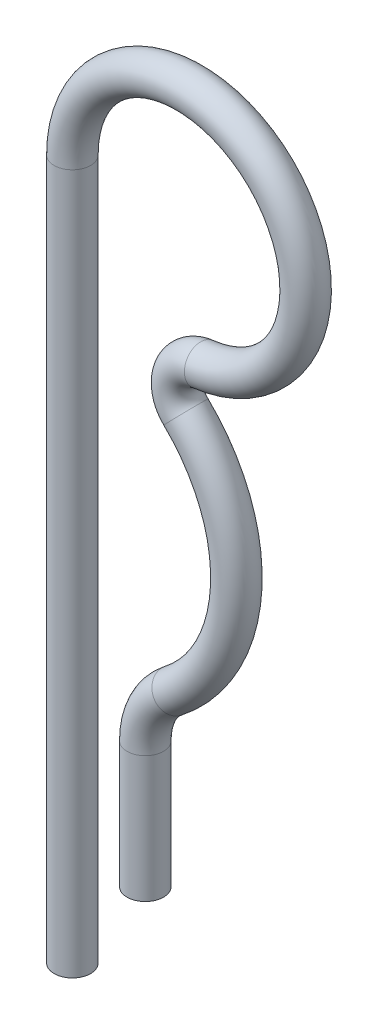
ISO-10303-21;
HEADER;
FILE_DESCRIPTION(('STEP AP214'),'2;1');
FILE_NAME('part.step','',(''),(''),'','','');
FILE_SCHEMA(('AUTOMOTIVE_DESIGN { 1 0 10303 214 1 1 1 1 }'));
ENDSEC;
DATA;
#1=APPLICATION_CONTEXT('core data for automotive mechanical design processes');
#2=APPLICATION_PROTOCOL_DEFINITION('international standard','automotive_design',2000,#1);
#3=PRODUCT_CONTEXT('',#1,'mechanical');
#4=PRODUCT('Part','Part','',(#3));
#5=PRODUCT_RELATED_PRODUCT_CATEGORY('part','',(#4));
#6=PRODUCT_DEFINITION_FORMATION('','',#4);
#7=PRODUCT_DEFINITION_CONTEXT('part definition',#1,'design');
#8=PRODUCT_DEFINITION('design','',#6,#7);
#9=PRODUCT_DEFINITION_SHAPE('','',#8);
#10=(LENGTH_UNIT() NAMED_UNIT(*) SI_UNIT(.MILLI.,.METRE.));
#11=(NAMED_UNIT(*) PLANE_ANGLE_UNIT() SI_UNIT($,.RADIAN.));
#12=(NAMED_UNIT(*) SI_UNIT($,.STERADIAN.) SOLID_ANGLE_UNIT());
#13=UNCERTAINTY_MEASURE_WITH_UNIT(LENGTH_MEASURE(1.E-05),#10,'distance_accuracy_value','');
#14=(GEOMETRIC_REPRESENTATION_CONTEXT(3) GLOBAL_UNCERTAINTY_ASSIGNED_CONTEXT((#13)) GLOBAL_UNIT_ASSIGNED_CONTEXT((#10,
#11,#12)) REPRESENTATION_CONTEXT('',''));
#15=CARTESIAN_POINT('',(0.,0.,0.));
#16=DIRECTION('',(0.,0.,1.));
#17=DIRECTION('',(1.,0.,0.));
#18=AXIS2_PLACEMENT_3D('',#15,#16,#17);
#19=CARTESIAN_POINT('',(-5.00000000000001,40.9610373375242,0.));
#20=DIRECTION('',(0.,-1.,0.));
#21=DIRECTION('',(1.,0.,0.));
#22=AXIS2_PLACEMENT_3D('',#19,#20,#21);
#23=CYLINDRICAL_SURFACE('',#22,1.25);
#24=CARTESIAN_POINT('',(-5.00000000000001,40.9610373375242,0.));
#25=DIRECTION('',(0.,-1.,0.));
#26=DIRECTION('',(0.,0.,1.));
#27=AXIS2_PLACEMENT_3D('',#24,#25,#26);
#28=CIRCLE('',#27,1.25);
#29=CARTESIAN_POINT('',(-6.25000000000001,40.9610373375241,0.));
#30=VERTEX_POINT('',#29);
#31=EDGE_CURVE('E37',#30,#30,#28,.T.);
#32=ORIENTED_EDGE('',*,*,#31,.T.);
#33=EDGE_LOOP('',(#32));
#34=FACE_BOUND('',#33,.T.);
#35=CARTESIAN_POINT('',(-5.00000000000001,-7.03896266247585,0.));
#36=DIRECTION('',(0.,-1.,0.));
#37=DIRECTION('',(0.,0.,1.));
#38=AXIS2_PLACEMENT_3D('',#35,#36,#37);
#39=CIRCLE('',#38,1.25);
#40=CARTESIAN_POINT('',(-5.00000000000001,-7.03896266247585,1.25));
#41=VERTEX_POINT('',#40);
#42=EDGE_CURVE('E10',#41,#41,#39,.T.);
#43=ORIENTED_EDGE('',*,*,#42,.F.);
#44=EDGE_LOOP('',(#43));
#45=FACE_BOUND('',#44,.T.);
#46=ADVANCED_FACE('F31',(#34,#45),#23,.T.);
#47=CARTESIAN_POINT('',(3.,40.9610373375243,0.));
#48=DIRECTION('',(0.,0.,1.));
#49=DIRECTION('',(1.,0.,0.));
#50=AXIS2_PLACEMENT_3D('',#47,#48,#49);
#51=TOROIDAL_SURFACE('',#50,8.00000000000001,1.25);
#52=CARTESIAN_POINT('',(3.94125977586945,33.0166034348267,0.));
#53=DIRECTION('',(0.993054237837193,0.117657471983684,0.));
#54=DIRECTION('',(0.,0.,1.));
#55=AXIS2_PLACEMENT_3D('',#52,#53,#54);
#56=CIRCLE('',#55,1.25);
#57=CARTESIAN_POINT('',(4.08833161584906,31.7752856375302,0.));
#58=VERTEX_POINT('',#57);
#59=EDGE_CURVE('E41',#58,#58,#56,.T.);
#60=CARTESIAN_POINT('',(3.,40.9610373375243,0.));
#61=DIRECTION('',(0.,0.,1.));
#62=DIRECTION('',(1.,0.,0.));
#63=AXIS2_PLACEMENT_3D('',#60,#61,#62);
#64=CIRCLE('',#63,9.25000000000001);
#65=EDGE_CURVE('',#58,#30,#64,.T.);
#66=ORIENTED_EDGE('',*,*,#59,.T.);
#67=ORIENTED_EDGE('',*,*,#31,.F.);
#68=ORIENTED_EDGE('',*,*,#65,.T.);
#69=ORIENTED_EDGE('',*,*,#65,.F.);
#70=EDGE_LOOP('',(#66,#68,#67,#69));
#71=FACE_BOUND('',#70,.T.);
#72=ADVANCED_FACE('F78',(#71),#51,.T.);
#73=CARTESIAN_POINT('',(4.17657471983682,31.0304949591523,0.));
#74=DIRECTION('',(0.,0.,-1.));
#75=DIRECTION('',(-1.,0.,0.));
#76=AXIS2_PLACEMENT_3D('',#73,#74,#75);
#77=TOROIDAL_SURFACE('',#76,2.,1.25);
#78=CARTESIAN_POINT('',(2.79143136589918,29.5877968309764,0.));
#79=DIRECTION('',(-0.721349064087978,0.692571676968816,0.));
#80=DIRECTION('',(0.,0.,1.));
#81=AXIS2_PLACEMENT_3D('',#78,#79,#80);
#82=CIRCLE('',#81,1.25);
#83=CARTESIAN_POINT('',(3.6571459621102,30.4894831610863,0.));
#84=VERTEX_POINT('',#83);
#85=EDGE_CURVE('E45',#84,#84,#82,.T.);
#86=ORIENTED_EDGE('',*,*,#85,.T.);
#87=EDGE_LOOP('',(#86));
#88=FACE_BOUND('',#87,.T.);
#89=ORIENTED_EDGE('',*,*,#59,.F.);
#90=EDGE_LOOP('',(#89));
#91=FACE_BOUND('',#90,.T.);
#92=ADVANCED_FACE('F82',(#88,#91),#77,.T.);
#93=CARTESIAN_POINT('',(-5.,21.4726198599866,0.));
#94=DIRECTION('',(0.,0.,1.));
#95=DIRECTION('',(1.,0.,0.));
#96=AXIS2_PLACEMENT_3D('',#93,#94,#95);
#97=TOROIDAL_SURFACE('',#96,11.25,1.25);
#98=CARTESIAN_POINT('',(1.92307692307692,12.6050663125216,0.));
#99=DIRECTION('',(0.788226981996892,0.615384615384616,0.));
#100=DIRECTION('',(0.,0.,1.));
#101=AXIS2_PLACEMENT_3D('',#98,#99,#100);
#102=CIRCLE('',#101,1.25);
#103=CARTESIAN_POINT('',(2.69230769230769,11.6197825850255,0.));
#104=VERTEX_POINT('',#103);
#105=EDGE_CURVE('E50',#104,#104,#102,.T.);
#106=CARTESIAN_POINT('',(-5.,21.4726198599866,0.));
#107=DIRECTION('',(0.,0.,1.));
#108=DIRECTION('',(1.,0.,0.));
#109=AXIS2_PLACEMENT_3D('',#106,#107,#108);
#110=CIRCLE('',#109,12.5);
#111=EDGE_CURVE('',#104,#84,#110,.T.);
#112=ORIENTED_EDGE('',*,*,#105,.T.);
#113=ORIENTED_EDGE('',*,*,#85,.F.);
#114=ORIENTED_EDGE('',*,*,#111,.T.);
#115=ORIENTED_EDGE('',*,*,#111,.F.);
#116=EDGE_LOOP('',(#112,#114,#113,#115));
#117=FACE_BOUND('',#116,.T.);
#118=ADVANCED_FACE('F88',(#117),#97,.T.);
#119=CARTESIAN_POINT('',(5.,8.66393140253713,0.));
#120=DIRECTION('',(0.,0.,-1.));
#121=DIRECTION('',(-1.,0.,0.));
#122=AXIS2_PLACEMENT_3D('',#119,#120,#121);
#123=TOROIDAL_SURFACE('',#122,5.,1.25);
#124=CARTESIAN_POINT('',(0.,8.66393140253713,0.));
#125=DIRECTION('',(0.,1.,0.));
#126=DIRECTION('',(0.,0.,1.));
#127=AXIS2_PLACEMENT_3D('',#124,#125,#126);
#128=CIRCLE('',#127,1.25);
#129=CARTESIAN_POINT('',(0.,8.66393140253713,1.25));
#130=VERTEX_POINT('',#129);
#131=EDGE_CURVE('E53',#130,#130,#128,.T.);
#132=ORIENTED_EDGE('',*,*,#131,.T.);
#133=EDGE_LOOP('',(#132));
#134=FACE_BOUND('',#133,.T.);
#135=ORIENTED_EDGE('',*,*,#105,.F.);
#136=EDGE_LOOP('',(#135));
#137=FACE_BOUND('',#136,.T.);
#138=ADVANCED_FACE('F60',(#134,#137),#123,.T.);
#139=CARTESIAN_POINT('',(0.,8.66393140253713,0.));
#140=DIRECTION('',(0.,-1.,0.));
#141=DIRECTION('',(1.,0.,0.));
#142=AXIS2_PLACEMENT_3D('',#139,#140,#141);
#143=CYLINDRICAL_SURFACE('',#142,1.25);
#144=ORIENTED_EDGE('',*,*,#131,.F.);
#145=EDGE_LOOP('',(#144));
#146=FACE_BOUND('',#145,.T.);
#147=CARTESIAN_POINT('',(0.,0.,0.));
#148=DIRECTION('',(0.,1.,0.));
#149=DIRECTION('',(0.,0.,1.));
#150=AXIS2_PLACEMENT_3D('',#147,#148,#149);
#151=CIRCLE('',#150,1.25);
#152=CARTESIAN_POINT('',(0.,0.,1.25));
#153=VERTEX_POINT('',#152);
#154=EDGE_CURVE('E54',#153,#153,#151,.T.);
#155=ORIENTED_EDGE('',*,*,#154,.T.);
#156=EDGE_LOOP('',(#155));
#157=FACE_BOUND('',#156,.T.);
#158=ADVANCED_FACE('F63',(#146,#157),#143,.T.);
#159=CARTESIAN_POINT('',(-5.00000000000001,-7.03896266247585,0.));
#160=DIRECTION('',(0.,-1.,0.));
#161=DIRECTION('',(0.,0.,1.));
#162=AXIS2_PLACEMENT_3D('',#159,#160,#161);
#163=PLANE('',#162);
#164=ORIENTED_EDGE('',*,*,#42,.T.);
#165=EDGE_LOOP('',(#164));
#166=FACE_BOUND('',#165,.T.);
#167=ADVANCED_FACE('F66',(#166),#163,.T.);
#168=CARTESIAN_POINT('',(0.,0.,0.));
#169=DIRECTION('',(0.,1.,0.));
#170=DIRECTION('',(0.,0.,1.));
#171=AXIS2_PLACEMENT_3D('',#168,#169,#170);
#172=PLANE('',#171);
#173=ORIENTED_EDGE('',*,*,#154,.F.);
#174=EDGE_LOOP('',(#173));
#175=FACE_BOUND('',#174,.T.);
#176=ADVANCED_FACE('F70',(#175),#172,.F.);
#177=CLOSED_SHELL('',(#46,#72,#92,#118,#138,#158,#167,#176));
#178=MANIFOLD_SOLID_BREP('B2',#177);
#179=ADVANCED_BREP_SHAPE_REPRESENTATION('',(#18,#178),#14);
#180=SHAPE_DEFINITION_REPRESENTATION(#9,#179);
ENDSEC;
END-ISO-10303-21;
